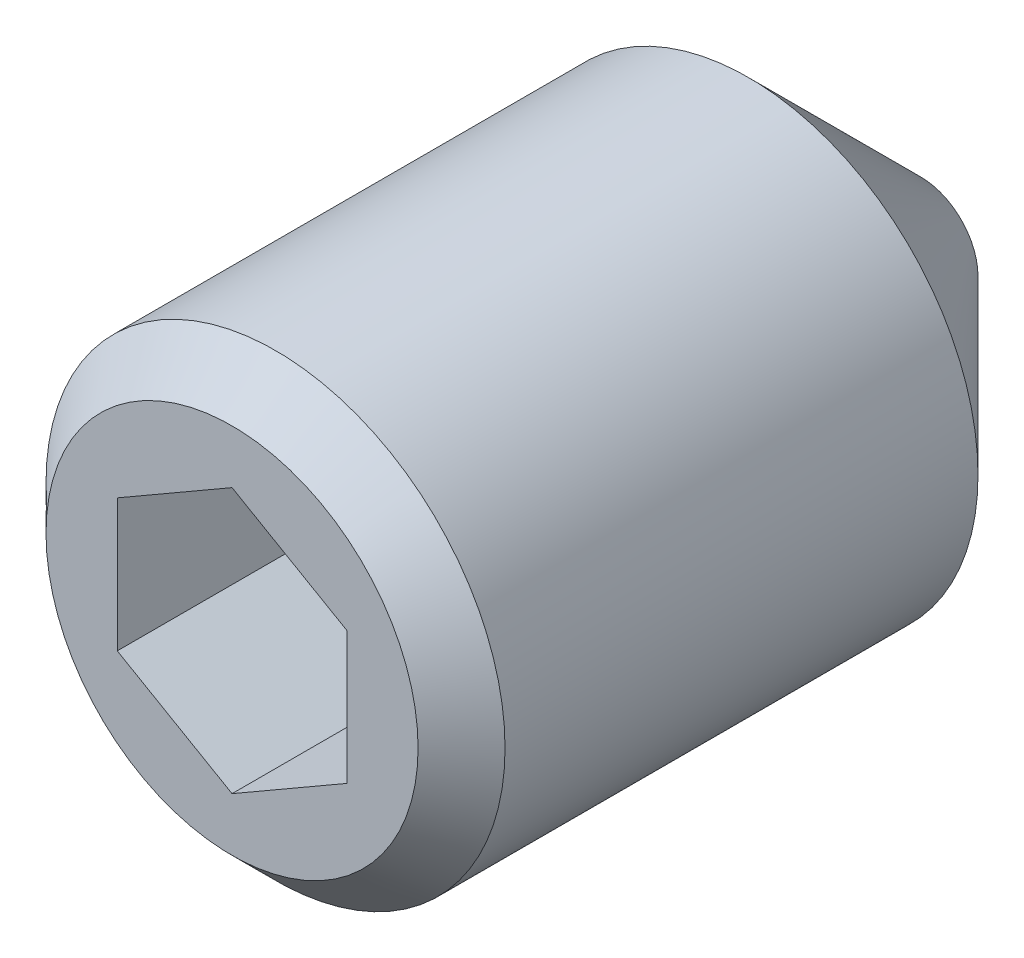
ISO-10303-21;
HEADER;
FILE_DESCRIPTION(('STEP AP214'),'2;1');
FILE_NAME('part.step','',(''),(''),'','','');
FILE_SCHEMA(('AUTOMOTIVE_DESIGN { 1 0 10303 214 1 1 1 1 }'));
ENDSEC;
DATA;
#1=APPLICATION_CONTEXT('core data for automotive mechanical design processes');
#2=APPLICATION_PROTOCOL_DEFINITION('international standard','automotive_design',2000,#1);
#3=PRODUCT_CONTEXT('',#1,'mechanical');
#4=PRODUCT('Part','Part','',(#3));
#5=PRODUCT_RELATED_PRODUCT_CATEGORY('part','',(#4));
#6=PRODUCT_DEFINITION_FORMATION('','',#4);
#7=PRODUCT_DEFINITION_CONTEXT('part definition',#1,'design');
#8=PRODUCT_DEFINITION('design','',#6,#7);
#9=PRODUCT_DEFINITION_SHAPE('','',#8);
#10=(LENGTH_UNIT() NAMED_UNIT(*) SI_UNIT(.MILLI.,.METRE.));
#11=(NAMED_UNIT(*) PLANE_ANGLE_UNIT() SI_UNIT($,.RADIAN.));
#12=(NAMED_UNIT(*) SI_UNIT($,.STERADIAN.) SOLID_ANGLE_UNIT());
#13=UNCERTAINTY_MEASURE_WITH_UNIT(LENGTH_MEASURE(1.E-05),#10,'distance_accuracy_value','');
#14=(GEOMETRIC_REPRESENTATION_CONTEXT(3) GLOBAL_UNCERTAINTY_ASSIGNED_CONTEXT((#13)) GLOBAL_UNIT_ASSIGNED_CONTEXT((#10,
#11,#12)) REPRESENTATION_CONTEXT('',''));
#15=CARTESIAN_POINT('',(0.,0.,0.));
#16=DIRECTION('',(0.,0.,1.));
#17=DIRECTION('',(1.,0.,0.));
#18=AXIS2_PLACEMENT_3D('',#15,#16,#17);
#19=CARTESIAN_POINT('',(0.,1.621125,0.));
#20=DIRECTION('',(0.,0.,-1.));
#21=DIRECTION('',(-1.,0.,0.));
#22=AXIS2_PLACEMENT_3D('',#19,#20,#21);
#23=PLANE('',#22);
#24=CARTESIAN_POINT('',(0.,0.,0.));
#25=DIRECTION('',(0.,0.,1.));
#26=DIRECTION('',(1.,0.,0.));
#27=AXIS2_PLACEMENT_3D('',#24,#25,#26);
#28=CIRCLE('',#27,1.621125);
#29=CARTESIAN_POINT('',(1.621125,0.,0.));
#30=VERTEX_POINT('',#29);
#31=EDGE_CURVE('E106',#30,#30,#28,.T.);
#32=ORIENTED_EDGE('',*,*,#31,.T.);
#33=EDGE_LOOP('',(#32));
#34=FACE_BOUND('',#33,.T.);
#35=DIRECTION('',(-0.866025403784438,-0.5,0.));
#36=VECTOR('',#35,1.);
#37=CARTESIAN_POINT('',(0.999999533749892,-0.57735,0.));
#38=LINE('',#37,#36);
#39=CARTESIAN_POINT('',(0.999999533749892,-0.57735,0.));
#40=VERTEX_POINT('',#39);
#41=CARTESIAN_POINT('',(0.,-1.1547,0.));
#42=VERTEX_POINT('',#41);
#43=EDGE_CURVE('E30',#40,#42,#38,.T.);
#44=ORIENTED_EDGE('',*,*,#43,.T.);
#45=DIRECTION('',(-0.866025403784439,0.5,0.));
#46=VECTOR('',#45,1.);
#47=CARTESIAN_POINT('',(0.,-1.1547,0.));
#48=LINE('',#47,#46);
#49=CARTESIAN_POINT('',(-0.999999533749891,-0.57735,0.));
#50=VERTEX_POINT('',#49);
#51=EDGE_CURVE('E152',#42,#50,#48,.T.);
#52=ORIENTED_EDGE('',*,*,#51,.T.);
#53=DIRECTION('',(0.,1.,0.));
#54=VECTOR('',#53,1.);
#55=CARTESIAN_POINT('',(-0.999999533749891,-0.57735,0.));
#56=LINE('',#55,#54);
#57=CARTESIAN_POINT('',(-0.999999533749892,0.57735,0.));
#58=VERTEX_POINT('',#57);
#59=EDGE_CURVE('E203',#50,#58,#56,.T.);
#60=ORIENTED_EDGE('',*,*,#59,.T.);
#61=DIRECTION('',(0.866025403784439,0.5,0.));
#62=VECTOR('',#61,1.);
#63=CARTESIAN_POINT('',(-0.999999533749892,0.57735,0.));
#64=LINE('',#63,#62);
#65=CARTESIAN_POINT('',(0.,1.1547,0.));
#66=VERTEX_POINT('',#65);
#67=EDGE_CURVE('E201',#58,#66,#64,.T.);
#68=ORIENTED_EDGE('',*,*,#67,.T.);
#69=DIRECTION('',(0.866025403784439,-0.5,0.));
#70=VECTOR('',#69,1.);
#71=CARTESIAN_POINT('',(0.,1.1547,0.));
#72=LINE('',#71,#70);
#73=CARTESIAN_POINT('',(0.999999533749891,0.57735,0.));
#74=VERTEX_POINT('',#73);
#75=EDGE_CURVE('E95',#66,#74,#72,.T.);
#76=ORIENTED_EDGE('',*,*,#75,.T.);
#77=DIRECTION('',(0.,-1.,0.));
#78=VECTOR('',#77,1.);
#79=CARTESIAN_POINT('',(0.999999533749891,0.57735,0.));
#80=LINE('',#79,#78);
#81=EDGE_CURVE('E91',#74,#40,#80,.T.);
#82=ORIENTED_EDGE('',*,*,#81,.T.);
#83=EDGE_LOOP('',(#44,#52,#60,#68,#76,#82));
#84=FACE_BOUND('',#83,.T.);
#85=ADVANCED_FACE('F16',(#34,#84),#23,.F.);
#86=CARTESIAN_POINT('',(0.,0.,-6.));
#87=DIRECTION('',(0.,0.,1.));
#88=DIRECTION('',(1.,0.,0.));
#89=AXIS2_PLACEMENT_3D('',#86,#87,#88);
#90=PLANE('',#89);
#91=CARTESIAN_POINT('',(0.,0.,-6.));
#92=DIRECTION('',(0.,0.,1.));
#93=DIRECTION('',(1.,0.,0.));
#94=AXIS2_PLACEMENT_3D('',#91,#92,#93);
#95=CIRCLE('',#94,0.5);
#96=CARTESIAN_POINT('',(0.500000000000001,0.,-6.));
#97=VERTEX_POINT('',#96);
#98=EDGE_CURVE('E10',#97,#97,#95,.T.);
#99=ORIENTED_EDGE('',*,*,#98,.F.);
#100=EDGE_LOOP('',(#99));
#101=FACE_BOUND('',#100,.T.);
#102=ADVANCED_FACE('F119',(#101),#90,.F.);
#103=CARTESIAN_POINT('',(0.,0.,-6.));
#104=DIRECTION('',(0.,0.,1.));
#105=DIRECTION('',(1.,0.,0.));
#106=AXIS2_PLACEMENT_3D('',#103,#104,#105);
#107=CONICAL_SURFACE('',#106,0.5,0.785398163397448);
#108=CARTESIAN_POINT('',(0.,0.,-4.5));
#109=DIRECTION('',(0.,0.,1.));
#110=DIRECTION('',(1.,0.,0.));
#111=AXIS2_PLACEMENT_3D('',#108,#109,#110);
#112=CIRCLE('',#111,2.);
#113=CARTESIAN_POINT('',(2.,0.,-4.5));
#114=VERTEX_POINT('',#113);
#115=EDGE_CURVE('E23',#114,#114,#112,.T.);
#116=CARTESIAN_POINT('',(2.,0.,-4.5));
#117=CARTESIAN_POINT('',(1.984375,0.,-4.515625));
#118=CARTESIAN_POINT('',(1.96875,0.,-4.53125));
#119=CARTESIAN_POINT('',(1.9375,0.,-4.5625));
#120=CARTESIAN_POINT('',(1.921875,0.,-4.578125));
#121=CARTESIAN_POINT('',(1.890625,0.,-4.609375));
#122=CARTESIAN_POINT('',(1.875,0.,-4.625));
#123=CARTESIAN_POINT('',(1.84375,0.,-4.65625));
#124=CARTESIAN_POINT('',(1.828125,0.,-4.671875));
#125=CARTESIAN_POINT('',(1.796875,0.,-4.703125));
#126=CARTESIAN_POINT('',(1.78125,0.,-4.71875));
#127=CARTESIAN_POINT('',(1.75,0.,-4.75));
#128=CARTESIAN_POINT('',(1.734375,0.,-4.765625));
#129=CARTESIAN_POINT('',(1.703125,0.,-4.796875));
#130=CARTESIAN_POINT('',(1.6875,0.,-4.8125));
#131=CARTESIAN_POINT('',(1.65625,0.,-4.84375));
#132=CARTESIAN_POINT('',(1.640625,0.,-4.859375));
#133=CARTESIAN_POINT('',(1.609375,0.,-4.890625));
#134=CARTESIAN_POINT('',(1.59375,0.,-4.90625));
#135=CARTESIAN_POINT('',(1.5625,0.,-4.9375));
#136=CARTESIAN_POINT('',(1.546875,0.,-4.953125));
#137=CARTESIAN_POINT('',(1.515625,0.,-4.984375));
#138=CARTESIAN_POINT('',(1.5,0.,-5.));
#139=CARTESIAN_POINT('',(1.46875,0.,-5.03125));
#140=CARTESIAN_POINT('',(1.453125,0.,-5.046875));
#141=CARTESIAN_POINT('',(1.421875,0.,-5.078125));
#142=CARTESIAN_POINT('',(1.40625,0.,-5.09375));
#143=CARTESIAN_POINT('',(1.375,0.,-5.125));
#144=CARTESIAN_POINT('',(1.359375,0.,-5.140625));
#145=CARTESIAN_POINT('',(1.328125,0.,-5.171875));
#146=CARTESIAN_POINT('',(1.3125,0.,-5.1875));
#147=CARTESIAN_POINT('',(1.28125,0.,-5.21875));
#148=CARTESIAN_POINT('',(1.265625,0.,-5.234375));
#149=CARTESIAN_POINT('',(1.234375,0.,-5.265625));
#150=CARTESIAN_POINT('',(1.21875,0.,-5.28125));
#151=CARTESIAN_POINT('',(1.1875,0.,-5.3125));
#152=CARTESIAN_POINT('',(1.171875,0.,-5.328125));
#153=CARTESIAN_POINT('',(1.140625,0.,-5.359375));
#154=CARTESIAN_POINT('',(1.125,0.,-5.375));
#155=CARTESIAN_POINT('',(1.09375,0.,-5.40625));
#156=CARTESIAN_POINT('',(1.078125,0.,-5.421875));
#157=CARTESIAN_POINT('',(1.046875,0.,-5.453125));
#158=CARTESIAN_POINT('',(1.03125,0.,-5.46875));
#159=CARTESIAN_POINT('',(1.,0.,-5.5));
#160=CARTESIAN_POINT('',(0.984375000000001,0.,-5.515625));
#161=CARTESIAN_POINT('',(0.953125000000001,0.,-5.546875));
#162=CARTESIAN_POINT('',(0.937500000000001,0.,-5.5625));
#163=CARTESIAN_POINT('',(0.906250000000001,0.,-5.59375));
#164=CARTESIAN_POINT('',(0.890625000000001,0.,-5.609375));
#165=CARTESIAN_POINT('',(0.859375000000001,0.,-5.640625));
#166=CARTESIAN_POINT('',(0.843750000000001,0.,-5.65625));
#167=CARTESIAN_POINT('',(0.812500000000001,0.,-5.6875));
#168=CARTESIAN_POINT('',(0.796875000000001,0.,-5.703125));
#169=CARTESIAN_POINT('',(0.765625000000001,0.,-5.734375));
#170=CARTESIAN_POINT('',(0.750000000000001,0.,-5.75));
#171=CARTESIAN_POINT('',(0.718750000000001,0.,-5.78125));
#172=CARTESIAN_POINT('',(0.703125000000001,0.,-5.796875));
#173=CARTESIAN_POINT('',(0.671875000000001,0.,-5.828125));
#174=CARTESIAN_POINT('',(0.656250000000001,0.,-5.84375));
#175=CARTESIAN_POINT('',(0.625000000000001,0.,-5.875));
#176=CARTESIAN_POINT('',(0.609375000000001,0.,-5.890625));
#177=CARTESIAN_POINT('',(0.578125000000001,0.,-5.921875));
#178=CARTESIAN_POINT('',(0.562500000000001,0.,-5.9375));
#179=CARTESIAN_POINT('',(0.531250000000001,0.,-5.96875));
#180=CARTESIAN_POINT('',(0.515625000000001,0.,-5.984375));
#181=CARTESIAN_POINT('',(0.500000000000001,0.,-6.));
#182=B_SPLINE_CURVE_WITH_KNOTS('',3,(#116,#117,#118,#119,#120,#121,#122,#123,#124,#125,#126,
#127,#128,#129,#130,#131,#132,#133,#134,#135,#136,#137,#138,#139,#140,#141,#142,#143,#144,#145,
#146,#147,#148,#149,#150,#151,#152,#153,#154,#155,#156,#157,#158,#159,#160,#161,#162,#163,#164,
#165,#166,#167,#168,#169,#170,#171,#172,#173,#174,#175,#176,#177,#178,#179,#180,#181),
.UNSPECIFIED.,.F.,.F.,(4,2,2,2,2,2,2,2,2,2,2,2,2,2,2,2,2,2,2,2,2,2,2,2,2,2,2,2,2,2,2,2,4),(0.,
0.0662912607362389,0.132582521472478,0.198873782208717,0.265165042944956,0.331456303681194,
0.397747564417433,0.464038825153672,0.530330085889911,0.59662134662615,0.662912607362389,
0.729203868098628,0.795495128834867,0.861786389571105,0.928077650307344,0.994368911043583,
1.06066017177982,1.12695143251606,1.1932426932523,1.25953395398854,1.32582521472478,
1.39211647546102,1.45840773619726,1.52469899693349,1.59099025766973,1.65728151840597,
1.72357277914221,1.78986403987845,1.85615530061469,1.92244656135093,1.98873782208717,
2.0550290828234,2.12132034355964),.UNSPECIFIED.);
#183=EDGE_CURVE('BSEAM116',#114,#97,#182,.T.);
#184=ORIENTED_EDGE('',*,*,#115,.F.);
#185=ORIENTED_EDGE('',*,*,#98,.T.);
#186=ORIENTED_EDGE('',*,*,#183,.T.);
#187=ORIENTED_EDGE('',*,*,#183,.F.);
#188=EDGE_LOOP('',(#184,#186,#185,#187));
#189=FACE_BOUND('',#188,.T.);
#190=ADVANCED_FACE('F116',(#189),#107,.T.);
#191=CARTESIAN_POINT('',(0.,0.,0.));
#192=DIRECTION('',(0.,0.,1.));
#193=DIRECTION('',(1.,0.,0.));
#194=AXIS2_PLACEMENT_3D('',#191,#192,#193);
#195=CYLINDRICAL_SURFACE('',#194,2.);
#196=CARTESIAN_POINT('',(0.,0.,-0.378875));
#197=DIRECTION('',(0.,0.,1.));
#198=DIRECTION('',(1.,0.,0.));
#199=AXIS2_PLACEMENT_3D('',#196,#197,#198);
#200=CIRCLE('',#199,2.);
#201=CARTESIAN_POINT('',(2.,0.,-0.378875));
#202=VERTEX_POINT('',#201);
#203=EDGE_CURVE('E109',#202,#202,#200,.T.);
#204=ORIENTED_EDGE('',*,*,#203,.F.);
#205=EDGE_LOOP('',(#204));
#206=FACE_BOUND('',#205,.T.);
#207=ORIENTED_EDGE('',*,*,#115,.T.);
#208=EDGE_LOOP('',(#207));
#209=FACE_BOUND('',#208,.T.);
#210=ADVANCED_FACE('F114',(#206,#209),#195,.T.);
#211=CARTESIAN_POINT('',(0.,0.,-0.378875));
#212=DIRECTION('',(0.,0.,-1.));
#213=DIRECTION('',(-1.,0.,0.));
#214=AXIS2_PLACEMENT_3D('',#211,#212,#213);
#215=CONICAL_SURFACE('',#214,2.,0.785398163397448);
#216=ORIENTED_EDGE('',*,*,#31,.F.);
#217=EDGE_LOOP('',(#216));
#218=FACE_BOUND('',#217,.T.);
#219=ORIENTED_EDGE('',*,*,#203,.T.);
#220=EDGE_LOOP('',(#219));
#221=FACE_BOUND('',#220,.T.);
#222=ADVANCED_FACE('F132',(#218,#221),#215,.T.);
#223=CARTESIAN_POINT('',(0.999999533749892,-0.57735,-3.16666635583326));
#224=DIRECTION('',(-0.5,0.866025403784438,0.));
#225=DIRECTION('',(0.866025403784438,0.5,0.));
#226=AXIS2_PLACEMENT_3D('',#223,#224,#225);
#227=PLANE('',#226);
#228=DIRECTION('',(0.,0.,1.));
#229=VECTOR('',#228,1.);
#230=CARTESIAN_POINT('',(0.,-1.1547,-3.16666635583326));
#231=LINE('',#230,#229);
#232=CARTESIAN_POINT('',(0.,-1.1547,-2.5));
#233=VERTEX_POINT('',#232);
#234=EDGE_CURVE('E104',#233,#42,#231,.T.);
#235=ORIENTED_EDGE('',*,*,#234,.T.);
#236=ORIENTED_EDGE('',*,*,#43,.F.);
#237=DIRECTION('',(0.,0.,1.));
#238=VECTOR('',#237,1.);
#239=CARTESIAN_POINT('',(0.999999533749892,-0.57735,-3.16666635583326));
#240=LINE('',#239,#238);
#241=CARTESIAN_POINT('',(0.999999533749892,-0.57735,-2.5));
#242=VERTEX_POINT('',#241);
#243=EDGE_CURVE('E85',#242,#40,#240,.T.);
#244=ORIENTED_EDGE('',*,*,#243,.F.);
#245=CARTESIAN_POINT('',(-1.99999999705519E-07,-1.15470011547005,-2.49999993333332));
#246=CARTESIAN_POINT('',(0.0439437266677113,-1.1293290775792,-2.51465215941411));
#247=CARTESIAN_POINT('',(0.0882669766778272,-1.1037390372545,-2.52797759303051));
#248=CARTESIAN_POINT('',(0.177680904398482,-1.05211588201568,-2.55123673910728));
#249=CARTESIAN_POINT('',(0.222773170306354,-1.0260818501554,-2.56116222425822));
#250=CARTESIAN_POINT('',(0.312398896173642,-0.974336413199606,-2.57661196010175));
#251=CARTESIAN_POINT('',(0.356918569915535,-0.94863296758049,-2.58223904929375));
#252=CARTESIAN_POINT('',(0.446167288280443,-0.897105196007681,-2.58895536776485));
#253=CARTESIAN_POINT('',(0.490896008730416,-0.871281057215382,-2.59005016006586));
#254=CARTESIAN_POINT('',(0.574466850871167,-0.823031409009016,-2.58776682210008));
#255=CARTESIAN_POINT('',(0.613321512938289,-0.800598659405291,-2.58494932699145));
#256=CARTESIAN_POINT('',(0.690777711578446,-0.755879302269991,-2.57602132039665));
#257=CARTESIAN_POINT('',(0.729378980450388,-0.733592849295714,-2.56990776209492));
#258=CARTESIAN_POINT('',(0.806994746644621,-0.688781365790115,-2.55462504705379));
#259=CARTESIAN_POINT('',(0.845999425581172,-0.666262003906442,-2.54539113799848));
#260=CARTESIAN_POINT('',(0.923427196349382,-0.621559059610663,-2.5244340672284));
#261=CARTESIAN_POINT('',(0.961851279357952,-0.599374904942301,-2.51271582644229));
#262=CARTESIAN_POINT('',(0.999999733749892,-0.577349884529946,-2.49999993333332));
#263=B_SPLINE_CURVE_WITH_KNOTS('',3,(#245,#246,#247,#248,#249,#250,#251,#252,#253,#254,#255,
#256,#257,#258,#259,#260,#261,#262),.UNSPECIFIED.,.F.,.F.,(4,2,2,2,2,2,2,2,4),(0.,
0.15850794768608,0.317396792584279,0.472353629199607,0.627120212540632,0.761853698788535,
0.896711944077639,1.03456070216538,1.17213892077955),.UNSPECIFIED.);
#264=EDGE_CURVE('E78',#233,#242,#263,.T.);
#265=ORIENTED_EDGE('',*,*,#264,.F.);
#266=EDGE_LOOP('',(#235,#236,#244,#265));
#267=FACE_BOUND('',#266,.T.);
#268=ADVANCED_FACE('F86',(#267),#227,.T.);
#269=CARTESIAN_POINT('',(0.,-1.1547,-3.16666635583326));
#270=DIRECTION('',(0.5,0.866025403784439,0.));
#271=DIRECTION('',(0.866025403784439,-0.5,0.));
#272=AXIS2_PLACEMENT_3D('',#269,#270,#271);
#273=PLANE('',#272);
#274=DIRECTION('',(0.,0.,1.));
#275=VECTOR('',#274,1.);
#276=CARTESIAN_POINT('',(-0.999999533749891,-0.57735,-3.16666635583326));
#277=LINE('',#276,#275);
#278=CARTESIAN_POINT('',(-0.999999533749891,-0.57735,-2.5));
#279=VERTEX_POINT('',#278);
#280=EDGE_CURVE('E102',#279,#50,#277,.T.);
#281=ORIENTED_EDGE('',*,*,#280,.T.);
#282=ORIENTED_EDGE('',*,*,#51,.F.);
#283=ORIENTED_EDGE('',*,*,#234,.F.);
#284=CARTESIAN_POINT('',(-0.999999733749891,-0.577349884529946,-2.49999993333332));
#285=CARTESIAN_POINT('',(-0.95605580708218,-0.602720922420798,-2.51465215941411));
#286=CARTESIAN_POINT('',(-0.911732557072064,-0.628310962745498,-2.52797759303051));
#287=CARTESIAN_POINT('',(-0.82231862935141,-0.679934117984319,-2.55123673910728));
#288=CARTESIAN_POINT('',(-0.777226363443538,-0.705968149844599,-2.56116222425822));
#289=CARTESIAN_POINT('',(-0.687600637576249,-0.757713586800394,-2.57661196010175));
#290=CARTESIAN_POINT('',(-0.643080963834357,-0.78341703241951,-2.58223904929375));
#291=CARTESIAN_POINT('',(-0.553832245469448,-0.834944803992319,-2.58895536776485));
#292=CARTESIAN_POINT('',(-0.509103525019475,-0.860768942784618,-2.59005016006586));
#293=CARTESIAN_POINT('',(-0.425532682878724,-0.909018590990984,-2.58776682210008));
#294=CARTESIAN_POINT('',(-0.386678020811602,-0.93145134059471,-2.58494932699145));
#295=CARTESIAN_POINT('',(-0.309221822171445,-0.976170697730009,-2.57602132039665));
#296=CARTESIAN_POINT('',(-0.270620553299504,-0.998457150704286,-2.56990776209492));
#297=CARTESIAN_POINT('',(-0.19300478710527,-1.04326863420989,-2.55462504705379));
#298=CARTESIAN_POINT('',(-0.15400010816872,-1.06578799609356,-2.54539113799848));
#299=CARTESIAN_POINT('',(-0.0765723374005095,-1.11049094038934,-2.5244340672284));
#300=CARTESIAN_POINT('',(-0.0381482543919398,-1.1326750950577,-2.51271582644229));
#301=CARTESIAN_POINT('',(2.00000000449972E-07,-1.15470011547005,-2.49999993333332));
#302=B_SPLINE_CURVE_WITH_KNOTS('',3,(#284,#285,#286,#287,#288,#289,#290,#291,#292,#293,#294,
#295,#296,#297,#298,#299,#300,#301),.UNSPECIFIED.,.F.,.F.,(4,2,2,2,2,2,2,2,4),(0.,
0.158507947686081,0.317396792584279,0.472353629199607,0.627120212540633,0.761853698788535,
0.896711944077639,1.03456070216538,1.17213892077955),.UNSPECIFIED.);
#303=EDGE_CURVE('E82',#279,#233,#302,.T.);
#304=ORIENTED_EDGE('',*,*,#303,.F.);
#305=EDGE_LOOP('',(#281,#282,#283,#304));
#306=FACE_BOUND('',#305,.T.);
#307=ADVANCED_FACE('F140',(#306),#273,.T.);
#308=CARTESIAN_POINT('',(-0.999999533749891,-0.57735,-3.16666635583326));
#309=DIRECTION('',(1.,0.,0.));
#310=DIRECTION('',(0.,-1.,0.));
#311=AXIS2_PLACEMENT_3D('',#308,#309,#310);
#312=PLANE('',#311);
#313=DIRECTION('',(0.,0.,1.));
#314=VECTOR('',#313,1.);
#315=CARTESIAN_POINT('',(-0.999999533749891,0.57735,-3.16666635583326));
#316=LINE('',#315,#314);
#317=CARTESIAN_POINT('',(-0.999999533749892,0.57735,-2.5));
#318=VERTEX_POINT('',#317);
#319=EDGE_CURVE('E100',#318,#58,#316,.T.);
#320=ORIENTED_EDGE('',*,*,#319,.T.);
#321=ORIENTED_EDGE('',*,*,#59,.F.);
#322=ORIENTED_EDGE('',*,*,#280,.F.);
#323=CARTESIAN_POINT('',(-0.999999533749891,-1.49514442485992,-2.12816488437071));
#324=CARTESIAN_POINT('',(-0.999999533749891,-1.45196058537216,-2.14888514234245));
#325=CARTESIAN_POINT('',(-0.999999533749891,-1.40867216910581,-2.16938648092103));
#326=CARTESIAN_POINT('',(-0.999999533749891,-1.32182886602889,-2.20983670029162));
#327=CARTESIAN_POINT('',(-0.999999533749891,-1.27827393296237,-2.2297854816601));
#328=CARTESIAN_POINT('',(-0.999999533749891,-1.14662287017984,-2.28885494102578));
#329=CARTESIAN_POINT('',(-0.999999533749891,-1.05805675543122,-2.32694755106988));
#330=CARTESIAN_POINT('',(-0.999999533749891,-0.876832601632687,-2.39975422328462));
#331=CARTESIAN_POINT('',(-0.999999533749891,-0.784128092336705,-2.4343541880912));
#332=CARTESIAN_POINT('',(-0.999999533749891,-0.596331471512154,-2.49592652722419));
#333=CARTESIAN_POINT('',(-0.999999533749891,-0.501246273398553,-2.52291870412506));
#334=CARTESIAN_POINT('',(-0.999999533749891,-0.356699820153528,-2.55422420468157));
#335=CARTESIAN_POINT('',(-0.999999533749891,-0.308244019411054,-2.56312487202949));
#336=CARTESIAN_POINT('',(-0.999999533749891,-0.210788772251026,-2.57725753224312));
#337=CARTESIAN_POINT('',(-0.999999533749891,-0.161789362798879,-2.58248977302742));
#338=CARTESIAN_POINT('',(-0.999999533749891,-0.0641060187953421,-2.58880097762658));
#339=CARTESIAN_POINT('',(-0.999999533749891,-0.0154253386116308,-2.58992895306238));
#340=CARTESIAN_POINT('',(-0.999999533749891,0.0818553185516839,-2.58806698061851));
#341=CARTESIAN_POINT('',(-0.999999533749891,0.130455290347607,-2.58507677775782));
#342=CARTESIAN_POINT('',(-0.999999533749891,0.250369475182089,-2.57288164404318));
#343=CARTESIAN_POINT('',(-0.999999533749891,0.321451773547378,-2.56139140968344));
#344=CARTESIAN_POINT('',(-0.999999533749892,0.462228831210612,-2.53175966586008));
#345=CARTESIAN_POINT('',(-0.999999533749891,0.531921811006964,-2.51361014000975));
#346=CARTESIAN_POINT('',(-0.999999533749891,0.671415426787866,-2.47213028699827));
#347=CARTESIAN_POINT('',(-0.999999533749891,0.741183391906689,-2.44869285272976));
#348=CARTESIAN_POINT('',(-0.999999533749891,0.879437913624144,-2.39843555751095));
#349=CARTESIAN_POINT('',(-0.999999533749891,0.947924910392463,-2.37161688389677));
#350=CARTESIAN_POINT('',(-0.999999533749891,1.12214343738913,-2.29994667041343));
#351=CARTESIAN_POINT('',(-0.999999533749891,1.22718279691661,-2.25342885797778));
#352=CARTESIAN_POINT('',(-0.999999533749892,1.43575432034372,-2.15712544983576));
#353=CARTESIAN_POINT('',(-0.999999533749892,1.53928608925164,-2.10733901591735));
#354=CARTESIAN_POINT('',(-0.999999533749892,1.74545808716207,-2.00566784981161));
#355=CARTESIAN_POINT('',(-0.999999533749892,1.84809715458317,-1.95378077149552));
#356=CARTESIAN_POINT('',(-0.999999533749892,2.0526880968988,-1.84866791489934));
#357=CARTESIAN_POINT('',(-0.999999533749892,2.15463994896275,-1.79544209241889));
#358=CARTESIAN_POINT('',(-0.999999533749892,2.34844973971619,-1.69314126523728));
#359=CARTESIAN_POINT('',(-0.999999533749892,2.4403514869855,-1.64414907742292));
#360=CARTESIAN_POINT('',(-0.999999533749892,2.62385933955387,-1.5456067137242));
#361=CARTESIAN_POINT('',(-0.999999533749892,2.71546543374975,-1.49605651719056));
#362=CARTESIAN_POINT('',(-0.999999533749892,2.89821715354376,-1.39666440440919));
#363=CARTESIAN_POINT('',(-0.999999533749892,2.98936335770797,-1.3468235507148));
#364=CARTESIAN_POINT('',(-0.999999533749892,3.1714714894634,-1.24681744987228));
#365=CARTESIAN_POINT('',(-0.999999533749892,3.26243342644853,-1.19665221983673));
#366=CARTESIAN_POINT('',(-0.999999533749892,3.35332915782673,-1.14636806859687));
#367=B_SPLINE_CURVE_WITH_KNOTS('',3,(#323,#324,#325,#326,#327,#328,#329,#330,#331,#332,#333,
#334,#335,#336,#337,#338,#339,#340,#341,#342,#343,#344,#345,#346,#347,#348,#349,#350,#351,#352,
#353,#354,#355,#356,#357,#358,#359,#360,#361,#362,#363,#364,#365,#366),.UNSPECIFIED.,.F.,.F.,(4,
2,2,2,2,2,2,2,2,2,2,2,2,2,2,2,2,2,2,2,2,4),(0.,0.143690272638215,0.287406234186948,
0.576560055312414,0.873259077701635,1.16917852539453,1.31686277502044,1.46453704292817,
1.61044194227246,1.75635587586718,1.97192442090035,2.18775332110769,2.40842488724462,
2.62901917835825,2.97354520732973,3.31815993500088,3.66317078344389,4.00819303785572,
4.320625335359,4.63306923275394,4.94471842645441,5.25635131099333),.UNSPECIFIED.);
#368=EDGE_CURVE('E177',#318,#279,#367,.F.);
#369=ORIENTED_EDGE('',*,*,#368,.F.);
#370=EDGE_LOOP('',(#320,#321,#322,#369));
#371=FACE_BOUND('',#370,.T.);
#372=ADVANCED_FACE('F181',(#371),#312,.T.);
#373=CARTESIAN_POINT('',(-0.999999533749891,0.57735,-3.16666635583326));
#374=DIRECTION('',(0.5,-0.866025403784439,0.));
#375=DIRECTION('',(-0.866025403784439,-0.5,0.));
#376=AXIS2_PLACEMENT_3D('',#373,#374,#375);
#377=PLANE('',#376);
#378=DIRECTION('',(0.,0.,1.));
#379=VECTOR('',#378,1.);
#380=CARTESIAN_POINT('',(0.,1.1547,-3.16666635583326));
#381=LINE('',#380,#379);
#382=CARTESIAN_POINT('',(0.,1.1547,-2.5));
#383=VERTEX_POINT('',#382);
#384=EDGE_CURVE('E93',#383,#66,#381,.T.);
#385=ORIENTED_EDGE('',*,*,#384,.T.);
#386=ORIENTED_EDGE('',*,*,#67,.F.);
#387=ORIENTED_EDGE('',*,*,#319,.F.);
#388=CARTESIAN_POINT('',(2.0000000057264E-07,1.15470011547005,-2.49999993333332));
#389=CARTESIAN_POINT('',(-0.0439437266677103,1.1293290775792,-2.51465215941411));
#390=CARTESIAN_POINT('',(-0.0882669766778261,1.1037390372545,-2.52797759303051));
#391=CARTESIAN_POINT('',(-0.177680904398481,1.05211588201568,-2.55123673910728));
#392=CARTESIAN_POINT('',(-0.222773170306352,1.0260818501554,-2.56116222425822));
#393=CARTESIAN_POINT('',(-0.312398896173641,0.974336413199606,-2.57661196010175));
#394=CARTESIAN_POINT('',(-0.356918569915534,0.94863296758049,-2.58223904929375));
#395=CARTESIAN_POINT('',(-0.446167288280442,0.897105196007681,-2.58895536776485));
#396=CARTESIAN_POINT('',(-0.490896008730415,0.871281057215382,-2.59005016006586));
#397=CARTESIAN_POINT('',(-0.574466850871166,0.823031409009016,-2.58776682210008));
#398=CARTESIAN_POINT('',(-0.613321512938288,0.800598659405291,-2.58494932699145));
#399=CARTESIAN_POINT('',(-0.690777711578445,0.755879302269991,-2.57602132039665));
#400=CARTESIAN_POINT('',(-0.729378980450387,0.733592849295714,-2.56990776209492));
#401=CARTESIAN_POINT('',(-0.806994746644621,0.688781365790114,-2.55462504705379));
#402=CARTESIAN_POINT('',(-0.845999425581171,0.666262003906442,-2.54539113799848));
#403=CARTESIAN_POINT('',(-0.923427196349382,0.621559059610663,-2.5244340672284));
#404=CARTESIAN_POINT('',(-0.961851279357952,0.599374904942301,-2.51271582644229));
#405=CARTESIAN_POINT('',(-0.999999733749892,0.577349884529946,-2.49999993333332));
#406=B_SPLINE_CURVE_WITH_KNOTS('',3,(#388,#389,#390,#391,#392,#393,#394,#395,#396,#397,#398,
#399,#400,#401,#402,#403,#404,#405),.UNSPECIFIED.,.F.,.F.,(4,2,2,2,2,2,2,2,4),(0.,
0.15850794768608,0.317396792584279,0.472353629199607,0.627120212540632,0.761853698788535,
0.89671194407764,1.03456070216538,1.17213892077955),.UNSPECIFIED.);
#407=EDGE_CURVE('E172',#383,#318,#406,.T.);
#408=ORIENTED_EDGE('',*,*,#407,.F.);
#409=EDGE_LOOP('',(#385,#386,#387,#408));
#410=FACE_BOUND('',#409,.T.);
#411=ADVANCED_FACE('F184',(#410),#377,.T.);
#412=CARTESIAN_POINT('',(0.,1.1547,-3.16666635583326));
#413=DIRECTION('',(-0.5,-0.866025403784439,0.));
#414=DIRECTION('',(-0.866025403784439,0.5,0.));
#415=AXIS2_PLACEMENT_3D('',#412,#413,#414);
#416=PLANE('',#415);
#417=DIRECTION('',(0.,0.,1.));
#418=VECTOR('',#417,1.);
#419=CARTESIAN_POINT('',(0.999999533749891,0.57735,-3.16666635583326));
#420=LINE('',#419,#418);
#421=CARTESIAN_POINT('',(0.999999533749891,0.57735,-2.5));
#422=VERTEX_POINT('',#421);
#423=EDGE_CURVE('E90',#422,#74,#420,.T.);
#424=ORIENTED_EDGE('',*,*,#423,.T.);
#425=ORIENTED_EDGE('',*,*,#75,.F.);
#426=ORIENTED_EDGE('',*,*,#384,.F.);
#427=CARTESIAN_POINT('',(0.999999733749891,0.577349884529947,-2.49999993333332));
#428=CARTESIAN_POINT('',(0.95605580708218,0.602720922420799,-2.51465215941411));
#429=CARTESIAN_POINT('',(0.911732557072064,0.628310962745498,-2.52797759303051));
#430=CARTESIAN_POINT('',(0.822318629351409,0.67993411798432,-2.55123673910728));
#431=CARTESIAN_POINT('',(0.777226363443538,0.7059681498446,-2.56116222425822));
#432=CARTESIAN_POINT('',(0.687600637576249,0.757713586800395,-2.57661196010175));
#433=CARTESIAN_POINT('',(0.643080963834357,0.783417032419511,-2.58223904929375));
#434=CARTESIAN_POINT('',(0.553832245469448,0.834944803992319,-2.58895536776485));
#435=CARTESIAN_POINT('',(0.509103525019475,0.860768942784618,-2.59005016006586));
#436=CARTESIAN_POINT('',(0.425532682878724,0.909018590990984,-2.58776682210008));
#437=CARTESIAN_POINT('',(0.386678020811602,0.93145134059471,-2.58494932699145));
#438=CARTESIAN_POINT('',(0.309221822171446,0.97617069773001,-2.57602132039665));
#439=CARTESIAN_POINT('',(0.270620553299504,0.998457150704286,-2.56990776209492));
#440=CARTESIAN_POINT('',(0.193004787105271,1.04326863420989,-2.55462504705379));
#441=CARTESIAN_POINT('',(0.15400010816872,1.06578799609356,-2.54539113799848));
#442=CARTESIAN_POINT('',(0.0765723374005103,1.11049094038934,-2.5244340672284));
#443=CARTESIAN_POINT('',(0.0381482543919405,1.1326750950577,-2.51271582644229));
#444=CARTESIAN_POINT('',(-1.99999999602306E-07,1.15470011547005,-2.49999993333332));
#445=B_SPLINE_CURVE_WITH_KNOTS('',3,(#427,#428,#429,#430,#431,#432,#433,#434,#435,#436,#437,
#438,#439,#440,#441,#442,#443,#444),.UNSPECIFIED.,.F.,.F.,(4,2,2,2,2,2,2,2,4),(0.,
0.15850794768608,0.317396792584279,0.472353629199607,0.627120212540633,0.761853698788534,
0.896711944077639,1.03456070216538,1.17213892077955),.UNSPECIFIED.);
#446=EDGE_CURVE('E38',#422,#383,#445,.T.);
#447=ORIENTED_EDGE('',*,*,#446,.F.);
#448=EDGE_LOOP('',(#424,#425,#426,#447));
#449=FACE_BOUND('',#448,.T.);
#450=ADVANCED_FACE('F188',(#449),#416,.T.);
#451=CARTESIAN_POINT('',(0.999999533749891,0.57735,-3.16666635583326));
#452=DIRECTION('',(-1.,0.,0.));
#453=DIRECTION('',(0.,1.,0.));
#454=AXIS2_PLACEMENT_3D('',#451,#452,#453);
#455=PLANE('',#454);
#456=ORIENTED_EDGE('',*,*,#243,.T.);
#457=ORIENTED_EDGE('',*,*,#81,.F.);
#458=ORIENTED_EDGE('',*,*,#423,.F.);
#459=CARTESIAN_POINT('',(0.999999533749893,-1.49514442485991,-2.12816488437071));
#460=CARTESIAN_POINT('',(0.999999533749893,-1.45196058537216,-2.14888514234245));
#461=CARTESIAN_POINT('',(0.999999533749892,-1.40867216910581,-2.16938648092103));
#462=CARTESIAN_POINT('',(0.999999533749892,-1.32182886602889,-2.20983670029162));
#463=CARTESIAN_POINT('',(0.999999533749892,-1.27827393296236,-2.2297854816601));
#464=CARTESIAN_POINT('',(0.999999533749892,-1.14662287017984,-2.28885494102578));
#465=CARTESIAN_POINT('',(0.999999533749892,-1.05805675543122,-2.32694755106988));
#466=CARTESIAN_POINT('',(0.999999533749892,-0.876832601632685,-2.39975422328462));
#467=CARTESIAN_POINT('',(0.999999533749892,-0.784128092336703,-2.4343541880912));
#468=CARTESIAN_POINT('',(0.999999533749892,-0.596331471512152,-2.49592652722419));
#469=CARTESIAN_POINT('',(0.999999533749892,-0.501246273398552,-2.52291870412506));
#470=CARTESIAN_POINT('',(0.999999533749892,-0.356699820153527,-2.55422420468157));
#471=CARTESIAN_POINT('',(0.999999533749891,-0.308244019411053,-2.56312487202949));
#472=CARTESIAN_POINT('',(0.999999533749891,-0.210788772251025,-2.57725753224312));
#473=CARTESIAN_POINT('',(0.999999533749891,-0.161789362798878,-2.58248977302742));
#474=CARTESIAN_POINT('',(0.999999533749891,-0.0641060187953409,-2.58880097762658));
#475=CARTESIAN_POINT('',(0.999999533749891,-0.0154253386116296,-2.58992895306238));
#476=CARTESIAN_POINT('',(0.999999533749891,0.0818553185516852,-2.58806698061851));
#477=CARTESIAN_POINT('',(0.999999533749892,0.130455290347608,-2.58507677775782));
#478=CARTESIAN_POINT('',(0.999999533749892,0.250369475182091,-2.57288164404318));
#479=CARTESIAN_POINT('',(0.999999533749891,0.32145177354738,-2.56139140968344));
#480=CARTESIAN_POINT('',(0.999999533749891,0.462228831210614,-2.53175966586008));
#481=CARTESIAN_POINT('',(0.999999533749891,0.531921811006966,-2.51361014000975));
#482=CARTESIAN_POINT('',(0.999999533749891,0.671415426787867,-2.47213028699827));
#483=CARTESIAN_POINT('',(0.999999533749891,0.741183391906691,-2.44869285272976));
#484=CARTESIAN_POINT('',(0.999999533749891,0.879437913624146,-2.39843555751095));
#485=CARTESIAN_POINT('',(0.999999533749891,0.947924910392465,-2.37161688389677));
#486=CARTESIAN_POINT('',(0.999999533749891,1.12214343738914,-2.29994667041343));
#487=CARTESIAN_POINT('',(0.999999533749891,1.22718279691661,-2.25342885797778));
#488=CARTESIAN_POINT('',(0.99999953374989,1.43575432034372,-2.15712544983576));
#489=CARTESIAN_POINT('',(0.99999953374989,1.53928608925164,-2.10733901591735));
#490=CARTESIAN_POINT('',(0.99999953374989,1.74545808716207,-2.00566784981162));
#491=CARTESIAN_POINT('',(0.99999953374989,1.84809715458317,-1.95378077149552));
#492=CARTESIAN_POINT('',(0.99999953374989,2.0526880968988,-1.84866791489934));
#493=CARTESIAN_POINT('',(0.99999953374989,2.15463994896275,-1.79544209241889));
#494=CARTESIAN_POINT('',(0.99999953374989,2.34844973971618,-1.69314126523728));
#495=CARTESIAN_POINT('',(0.999999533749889,2.4403514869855,-1.64414907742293));
#496=CARTESIAN_POINT('',(0.999999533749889,2.62385933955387,-1.54560671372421));
#497=CARTESIAN_POINT('',(0.999999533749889,2.71546543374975,-1.49605651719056));
#498=CARTESIAN_POINT('',(0.999999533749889,2.89821715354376,-1.39666440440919));
#499=CARTESIAN_POINT('',(0.999999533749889,2.98936335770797,-1.3468235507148));
#500=CARTESIAN_POINT('',(0.999999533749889,3.1714714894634,-1.24681744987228));
#501=CARTESIAN_POINT('',(0.999999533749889,3.26243342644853,-1.19665221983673));
#502=CARTESIAN_POINT('',(0.999999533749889,3.35332915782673,-1.14636806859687));
#503=B_SPLINE_CURVE_WITH_KNOTS('',3,(#459,#460,#461,#462,#463,#464,#465,#466,#467,#468,#469,
#470,#471,#472,#473,#474,#475,#476,#477,#478,#479,#480,#481,#482,#483,#484,#485,#486,#487,#488,
#489,#490,#491,#492,#493,#494,#495,#496,#497,#498,#499,#500,#501,#502),.UNSPECIFIED.,.F.,.F.,(4,
2,2,2,2,2,2,2,2,2,2,2,2,2,2,2,2,2,2,2,2,4),(0.,0.143690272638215,0.287406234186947,
0.576560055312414,0.873259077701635,1.16917852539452,1.31686277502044,1.46453704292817,
1.61044194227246,1.75635587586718,1.97192442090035,2.18775332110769,2.40842488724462,
2.62901917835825,2.97354520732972,3.31815993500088,3.66317078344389,4.00819303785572,
4.320625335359,4.63306923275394,4.94471842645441,5.25635131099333),.UNSPECIFIED.);
#504=EDGE_CURVE('E79',#242,#422,#503,.T.);
#505=ORIENTED_EDGE('',*,*,#504,.F.);
#506=EDGE_LOOP('',(#456,#457,#458,#505));
#507=FACE_BOUND('',#506,.T.);
#508=ADVANCED_FACE('F74',(#507),#455,.T.);
#509=CARTESIAN_POINT('',(0.,0.,-3.16666635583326));
#510=DIRECTION('',(0.,0.,1.));
#511=DIRECTION('',(1.,0.,0.));
#512=AXIS2_PLACEMENT_3D('',#509,#510,#511);
#513=CONICAL_SURFACE('',#512,0.,1.0471975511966);
#514=CARTESIAN_POINT('',(0.,0.,-3.16666635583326));
#515=VERTEX_POINT('',#514);
#516=VERTEX_LOOP('',#515);
#517=FACE_BOUND('',#516,.T.);
#518=ORIENTED_EDGE('',*,*,#264,.T.);
#519=ORIENTED_EDGE('',*,*,#504,.T.);
#520=ORIENTED_EDGE('',*,*,#446,.T.);
#521=ORIENTED_EDGE('',*,*,#407,.T.);
#522=ORIENTED_EDGE('',*,*,#368,.T.);
#523=ORIENTED_EDGE('',*,*,#303,.T.);
#524=EDGE_LOOP('',(#518,#519,#520,#521,#522,#523));
#525=FACE_BOUND('',#524,.T.);
#526=ADVANCED_FACE('F71',(#517,#525),#513,.F.);
#527=CLOSED_SHELL('',(#85,#102,#190,#210,#222,#268,#307,#372,#411,#450,#508,#526));
#528=MANIFOLD_SOLID_BREP('B1',#527);
#529=ADVANCED_BREP_SHAPE_REPRESENTATION('',(#18,#528),#14);
#530=SHAPE_DEFINITION_REPRESENTATION(#9,#529);
ENDSEC;
END-ISO-10303-21;
